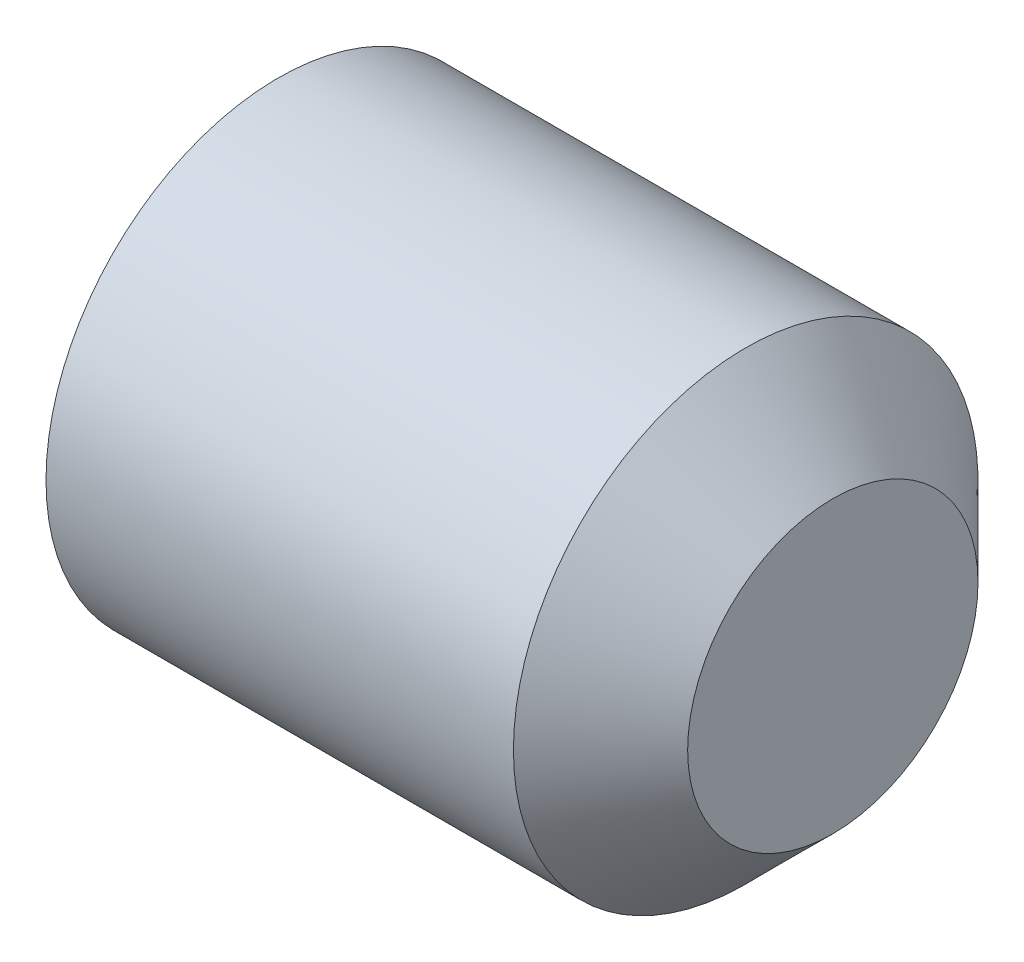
ISO-10303-21;
HEADER;
FILE_DESCRIPTION(('STEP AP214'),'2;1');
FILE_NAME('part.step','',(''),(''),'','','');
FILE_SCHEMA(('AUTOMOTIVE_DESIGN { 1 0 10303 214 1 1 1 1 }'));
ENDSEC;
DATA;
#1=APPLICATION_CONTEXT('core data for automotive mechanical design processes');
#2=APPLICATION_PROTOCOL_DEFINITION('international standard','automotive_design',2000,#1);
#3=PRODUCT_CONTEXT('',#1,'mechanical');
#4=PRODUCT('Part','Part','',(#3));
#5=PRODUCT_RELATED_PRODUCT_CATEGORY('part','',(#4));
#6=PRODUCT_DEFINITION_FORMATION('','',#4);
#7=PRODUCT_DEFINITION_CONTEXT('part definition',#1,'design');
#8=PRODUCT_DEFINITION('design','',#6,#7);
#9=PRODUCT_DEFINITION_SHAPE('','',#8);
#10=(LENGTH_UNIT() NAMED_UNIT(*) SI_UNIT(.MILLI.,.METRE.));
#11=(NAMED_UNIT(*) PLANE_ANGLE_UNIT() SI_UNIT($,.RADIAN.));
#12=(NAMED_UNIT(*) SI_UNIT($,.STERADIAN.) SOLID_ANGLE_UNIT());
#13=UNCERTAINTY_MEASURE_WITH_UNIT(LENGTH_MEASURE(1.E-05),#10,'distance_accuracy_value','');
#14=(GEOMETRIC_REPRESENTATION_CONTEXT(3) GLOBAL_UNCERTAINTY_ASSIGNED_CONTEXT((#13)) GLOBAL_UNIT_ASSIGNED_CONTEXT((#10,
#11,#12)) REPRESENTATION_CONTEXT('',''));
#15=CARTESIAN_POINT('',(0.,0.,0.));
#16=DIRECTION('',(0.,0.,1.));
#17=DIRECTION('',(1.,0.,0.));
#18=AXIS2_PLACEMENT_3D('',#15,#16,#17);
#19=CARTESIAN_POINT('',(0.,0.,0.));
#20=DIRECTION('',(-1.,0.,0.));
#21=DIRECTION('',(0.,0.,1.));
#22=AXIS2_PLACEMENT_3D('',#19,#20,#21);
#23=PLANE('',#22);
#24=CARTESIAN_POINT('',(0.,0.,0.));
#25=DIRECTION('',(-1.,0.,0.));
#26=DIRECTION('',(0.,0.,1.));
#27=AXIS2_PLACEMENT_3D('',#24,#25,#26);
#28=CIRCLE('',#27,1.61);
#29=CARTESIAN_POINT('',(0.,0.,1.61));
#30=VERTEX_POINT('',#29);
#31=EDGE_CURVE('E86',#30,#30,#28,.T.);
#32=ORIENTED_EDGE('',*,*,#31,.T.);
#33=EDGE_LOOP('',(#32));
#34=FACE_BOUND('',#33,.T.);
#35=DIRECTION('',(0.,0.,-1.));
#36=VECTOR('',#35,1.);
#37=CARTESIAN_POINT('',(0.,1.,0.577350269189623));
#38=LINE('',#37,#36);
#39=CARTESIAN_POINT('',(0.,1.,0.577350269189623));
#40=VERTEX_POINT('',#39);
#41=CARTESIAN_POINT('',(0.,1.,-0.577350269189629));
#42=VERTEX_POINT('',#41);
#43=EDGE_CURVE('E100',#40,#42,#38,.T.);
#44=ORIENTED_EDGE('',*,*,#43,.F.);
#45=DIRECTION('',(0.,-0.866025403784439,0.5));
#46=VECTOR('',#45,1.);
#47=CARTESIAN_POINT('',(0.,1.,0.577350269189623));
#48=LINE('',#47,#46);
#49=CARTESIAN_POINT('',(0.,0.,1.15470053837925));
#50=VERTEX_POINT('',#49);
#51=EDGE_CURVE('E45',#40,#50,#48,.T.);
#52=ORIENTED_EDGE('',*,*,#51,.T.);
#53=DIRECTION('',(0.,0.866025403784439,0.5));
#54=VECTOR('',#53,1.);
#55=CARTESIAN_POINT('',(0.,-0.999999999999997,0.577350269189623));
#56=LINE('',#55,#54);
#57=CARTESIAN_POINT('',(0.,-0.999999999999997,0.577350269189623));
#58=VERTEX_POINT('',#57);
#59=EDGE_CURVE('E90',#58,#50,#56,.T.);
#60=ORIENTED_EDGE('',*,*,#59,.F.);
#61=DIRECTION('',(0.,0.,-1.));
#62=VECTOR('',#61,1.);
#63=CARTESIAN_POINT('',(0.,-0.999999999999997,0.577350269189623));
#64=LINE('',#63,#62);
#65=CARTESIAN_POINT('',(0.,-0.999999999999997,-0.577350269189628));
#66=VERTEX_POINT('',#65);
#67=EDGE_CURVE('E95',#58,#66,#64,.T.);
#68=ORIENTED_EDGE('',*,*,#67,.T.);
#69=DIRECTION('',(0.,0.866025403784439,-0.5));
#70=VECTOR('',#69,1.);
#71=CARTESIAN_POINT('',(0.,-0.999999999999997,-0.577350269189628));
#72=LINE('',#71,#70);
#73=CARTESIAN_POINT('',(0.,0.,-1.15470053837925));
#74=VERTEX_POINT('',#73);
#75=EDGE_CURVE('E104',#66,#74,#72,.T.);
#76=ORIENTED_EDGE('',*,*,#75,.T.);
#77=DIRECTION('',(0.,-0.866025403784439,-0.499999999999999));
#78=VECTOR('',#77,1.);
#79=CARTESIAN_POINT('',(0.,1.,-0.577350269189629));
#80=LINE('',#79,#78);
#81=EDGE_CURVE('E107',#42,#74,#80,.T.);
#82=ORIENTED_EDGE('',*,*,#81,.F.);
#83=EDGE_LOOP('',(#44,#52,#60,#68,#76,#82));
#84=FACE_BOUND('',#83,.T.);
#85=ADVANCED_FACE('F30',(#34,#84),#23,.T.);
#86=CARTESIAN_POINT('',(5.,1.25,0.));
#87=DIRECTION('',(1.,0.,0.));
#88=DIRECTION('',(0.,0.,-1.));
#89=AXIS2_PLACEMENT_3D('',#86,#87,#88);
#90=PLANE('',#89);
#91=CARTESIAN_POINT('',(5.,0.,0.));
#92=DIRECTION('',(-1.,0.,0.));
#93=DIRECTION('',(0.,0.,1.));
#94=AXIS2_PLACEMENT_3D('',#91,#92,#93);
#95=CIRCLE('',#94,1.25);
#96=CARTESIAN_POINT('',(5.,0.,1.25));
#97=VERTEX_POINT('',#96);
#98=EDGE_CURVE('E11',#97,#97,#95,.T.);
#99=ORIENTED_EDGE('',*,*,#98,.F.);
#100=EDGE_LOOP('',(#99));
#101=FACE_BOUND('',#100,.T.);
#102=ADVANCED_FACE('F32',(#101),#90,.T.);
#103=CARTESIAN_POINT('',(4.25000000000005,0.,0.));
#104=DIRECTION('',(-1.,0.,0.));
#105=DIRECTION('',(0.,0.,1.));
#106=AXIS2_PLACEMENT_3D('',#103,#104,#105);
#107=CONICAL_SURFACE('',#106,2.,0.785398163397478);
#108=ORIENTED_EDGE('',*,*,#98,.T.);
#109=EDGE_LOOP('',(#108));
#110=FACE_BOUND('',#109,.T.);
#111=CARTESIAN_POINT('',(4.25000000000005,0.,0.));
#112=DIRECTION('',(-1.,0.,0.));
#113=DIRECTION('',(0.,0.,1.));
#114=AXIS2_PLACEMENT_3D('',#111,#112,#113);
#115=CIRCLE('',#114,2.);
#116=CARTESIAN_POINT('',(4.25000000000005,0.,2.));
#117=VERTEX_POINT('',#116);
#118=EDGE_CURVE('E38',#117,#117,#115,.T.);
#119=ORIENTED_EDGE('',*,*,#118,.F.);
#120=EDGE_LOOP('',(#119));
#121=FACE_BOUND('',#120,.T.);
#122=ADVANCED_FACE('F142',(#110,#121),#107,.T.);
#123=CARTESIAN_POINT('',(-12.7,0.,0.));
#124=DIRECTION('',(-1.,0.,0.));
#125=DIRECTION('',(0.,0.,1.));
#126=AXIS2_PLACEMENT_3D('',#123,#124,#125);
#127=CYLINDRICAL_SURFACE('',#126,2.);
#128=ORIENTED_EDGE('',*,*,#118,.T.);
#129=EDGE_LOOP('',(#128));
#130=FACE_BOUND('',#129,.T.);
#131=CARTESIAN_POINT('',(0.225166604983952,0.,0.));
#132=DIRECTION('',(-1.,0.,0.));
#133=DIRECTION('',(0.,0.,1.));
#134=AXIS2_PLACEMENT_3D('',#131,#132,#133);
#135=CIRCLE('',#134,2.);
#136=CARTESIAN_POINT('',(0.225166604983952,0.,2.));
#137=VERTEX_POINT('',#136);
#138=EDGE_CURVE('E134',#137,#137,#135,.T.);
#139=ORIENTED_EDGE('',*,*,#138,.F.);
#140=EDGE_LOOP('',(#139));
#141=FACE_BOUND('',#140,.T.);
#142=ADVANCED_FACE('F139',(#130,#141),#127,.T.);
#143=CARTESIAN_POINT('',(0.,0.,0.));
#144=DIRECTION('',(1.,0.,0.));
#145=DIRECTION('',(0.,0.,-1.));
#146=AXIS2_PLACEMENT_3D('',#143,#144,#145);
#147=CONICAL_SURFACE('',#146,1.61,1.0471975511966);
#148=ORIENTED_EDGE('',*,*,#138,.T.);
#149=EDGE_LOOP('',(#148));
#150=FACE_BOUND('',#149,.T.);
#151=ORIENTED_EDGE('',*,*,#31,.F.);
#152=EDGE_LOOP('',(#151));
#153=FACE_BOUND('',#152,.T.);
#154=ADVANCED_FACE('F149',(#150,#153),#147,.T.);
#155=CARTESIAN_POINT('',(2.3,1.,0.577350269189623));
#156=DIRECTION('',(0.,-0.5,-0.866025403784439));
#157=DIRECTION('',(0.,0.866025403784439,-0.5));
#158=AXIS2_PLACEMENT_3D('',#155,#156,#157);
#159=PLANE('',#158);
#160=ORIENTED_EDGE('',*,*,#51,.F.);
#161=DIRECTION('',(-1.,0.,0.));
#162=VECTOR('',#161,1.);
#163=CARTESIAN_POINT('',(2.3,1.,0.577350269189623));
#164=LINE('',#163,#162);
#165=CARTESIAN_POINT('',(2.3,1.,0.577350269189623));
#166=VERTEX_POINT('',#165);
#167=EDGE_CURVE('E49',#166,#40,#164,.T.);
#168=ORIENTED_EDGE('',*,*,#167,.F.);
#169=DIRECTION('',(0.,-0.866025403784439,0.5));
#170=VECTOR('',#169,1.);
#171=CARTESIAN_POINT('',(2.3,1.,0.577350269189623));
#172=LINE('',#171,#170);
#173=CARTESIAN_POINT('',(2.3,0.,1.15470053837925));
#174=VERTEX_POINT('',#173);
#175=EDGE_CURVE('E82',#166,#174,#172,.T.);
#176=ORIENTED_EDGE('',*,*,#175,.T.);
#177=DIRECTION('',(-1.,0.,0.));
#178=VECTOR('',#177,1.);
#179=CARTESIAN_POINT('',(2.3,0.,1.15470053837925));
#180=LINE('',#179,#178);
#181=EDGE_CURVE('E79',#174,#50,#180,.T.);
#182=ORIENTED_EDGE('',*,*,#181,.T.);
#183=EDGE_LOOP('',(#160,#168,#176,#182));
#184=FACE_BOUND('',#183,.T.);
#185=ADVANCED_FACE('F81',(#184),#159,.T.);
#186=CARTESIAN_POINT('',(2.3,-0.999999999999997,0.577350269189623));
#187=DIRECTION('',(0.,-0.5,0.866025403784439));
#188=DIRECTION('',(0.,-0.866025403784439,-0.5));
#189=AXIS2_PLACEMENT_3D('',#186,#187,#188);
#190=PLANE('',#189);
#191=ORIENTED_EDGE('',*,*,#59,.T.);
#192=ORIENTED_EDGE('',*,*,#181,.F.);
#193=DIRECTION('',(0.,0.866025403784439,0.5));
#194=VECTOR('',#193,1.);
#195=CARTESIAN_POINT('',(2.3,-0.999999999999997,0.577350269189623));
#196=LINE('',#195,#194);
#197=CARTESIAN_POINT('',(2.3,-0.999999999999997,0.577350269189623));
#198=VERTEX_POINT('',#197);
#199=EDGE_CURVE('E112',#198,#174,#196,.T.);
#200=ORIENTED_EDGE('',*,*,#199,.F.);
#201=DIRECTION('',(-1.,0.,0.));
#202=VECTOR('',#201,1.);
#203=CARTESIAN_POINT('',(2.3,-0.999999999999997,0.577350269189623));
#204=LINE('',#203,#202);
#205=EDGE_CURVE('E87',#198,#58,#204,.T.);
#206=ORIENTED_EDGE('',*,*,#205,.T.);
#207=EDGE_LOOP('',(#191,#192,#200,#206));
#208=FACE_BOUND('',#207,.T.);
#209=ADVANCED_FACE('F91',(#208),#190,.F.);
#210=CARTESIAN_POINT('',(2.3,-0.999999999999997,0.577350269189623));
#211=DIRECTION('',(0.,1.,0.));
#212=DIRECTION('',(0.,0.,1.));
#213=AXIS2_PLACEMENT_3D('',#210,#211,#212);
#214=PLANE('',#213);
#215=ORIENTED_EDGE('',*,*,#67,.F.);
#216=ORIENTED_EDGE('',*,*,#205,.F.);
#217=DIRECTION('',(0.,0.,-1.));
#218=VECTOR('',#217,1.);
#219=CARTESIAN_POINT('',(2.3,-0.999999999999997,0.577350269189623));
#220=LINE('',#219,#218);
#221=CARTESIAN_POINT('',(2.3,-0.999999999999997,-0.577350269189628));
#222=VERTEX_POINT('',#221);
#223=EDGE_CURVE('E114',#198,#222,#220,.T.);
#224=ORIENTED_EDGE('',*,*,#223,.T.);
#225=DIRECTION('',(-1.,0.,0.));
#226=VECTOR('',#225,1.);
#227=CARTESIAN_POINT('',(2.3,-0.999999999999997,-0.577350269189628));
#228=LINE('',#227,#226);
#229=EDGE_CURVE('E129',#222,#66,#228,.T.);
#230=ORIENTED_EDGE('',*,*,#229,.T.);
#231=EDGE_LOOP('',(#215,#216,#224,#230));
#232=FACE_BOUND('',#231,.T.);
#233=ADVANCED_FACE('F171',(#232),#214,.T.);
#234=CARTESIAN_POINT('',(2.3,-0.999999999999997,-0.577350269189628));
#235=DIRECTION('',(0.,0.5,0.866025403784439));
#236=DIRECTION('',(0.,-0.866025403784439,0.5));
#237=AXIS2_PLACEMENT_3D('',#234,#235,#236);
#238=PLANE('',#237);
#239=ORIENTED_EDGE('',*,*,#75,.F.);
#240=ORIENTED_EDGE('',*,*,#229,.F.);
#241=DIRECTION('',(0.,0.866025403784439,-0.5));
#242=VECTOR('',#241,1.);
#243=CARTESIAN_POINT('',(2.3,-0.999999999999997,-0.577350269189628));
#244=LINE('',#243,#242);
#245=CARTESIAN_POINT('',(2.3,0.,-1.15470053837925));
#246=VERTEX_POINT('',#245);
#247=EDGE_CURVE('E116',#222,#246,#244,.T.);
#248=ORIENTED_EDGE('',*,*,#247,.T.);
#249=DIRECTION('',(-1.,0.,0.));
#250=VECTOR('',#249,1.);
#251=CARTESIAN_POINT('',(2.3,0.,-1.15470053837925));
#252=LINE('',#251,#250);
#253=EDGE_CURVE('E127',#246,#74,#252,.T.);
#254=ORIENTED_EDGE('',*,*,#253,.T.);
#255=EDGE_LOOP('',(#239,#240,#248,#254));
#256=FACE_BOUND('',#255,.T.);
#257=ADVANCED_FACE('F175',(#256),#238,.T.);
#258=CARTESIAN_POINT('',(2.3,1.,-0.577350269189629));
#259=DIRECTION('',(0.,0.5,-0.866025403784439));
#260=DIRECTION('',(0.,0.866025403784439,0.5));
#261=AXIS2_PLACEMENT_3D('',#258,#259,#260);
#262=PLANE('',#261);
#263=ORIENTED_EDGE('',*,*,#81,.T.);
#264=ORIENTED_EDGE('',*,*,#253,.F.);
#265=DIRECTION('',(0.,-0.866025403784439,-0.499999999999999));
#266=VECTOR('',#265,1.);
#267=CARTESIAN_POINT('',(2.3,1.,-0.577350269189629));
#268=LINE('',#267,#266);
#269=CARTESIAN_POINT('',(2.3,1.,-0.577350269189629));
#270=VERTEX_POINT('',#269);
#271=EDGE_CURVE('E118',#270,#246,#268,.T.);
#272=ORIENTED_EDGE('',*,*,#271,.F.);
#273=DIRECTION('',(-1.,0.,0.));
#274=VECTOR('',#273,1.);
#275=CARTESIAN_POINT('',(2.3,1.,-0.577350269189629));
#276=LINE('',#275,#274);
#277=EDGE_CURVE('E125',#270,#42,#276,.T.);
#278=ORIENTED_EDGE('',*,*,#277,.T.);
#279=EDGE_LOOP('',(#263,#264,#272,#278));
#280=FACE_BOUND('',#279,.T.);
#281=ADVANCED_FACE('F181',(#280),#262,.F.);
#282=CARTESIAN_POINT('',(2.3,1.,0.577350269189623));
#283=DIRECTION('',(0.,1.,0.));
#284=DIRECTION('',(0.,0.,1.));
#285=AXIS2_PLACEMENT_3D('',#282,#283,#284);
#286=PLANE('',#285);
#287=ORIENTED_EDGE('',*,*,#43,.T.);
#288=ORIENTED_EDGE('',*,*,#277,.F.);
#289=DIRECTION('',(0.,0.,-1.));
#290=VECTOR('',#289,1.);
#291=CARTESIAN_POINT('',(2.3,1.,0.577350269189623));
#292=LINE('',#291,#290);
#293=EDGE_CURVE('E121',#166,#270,#292,.T.);
#294=ORIENTED_EDGE('',*,*,#293,.F.);
#295=ORIENTED_EDGE('',*,*,#167,.T.);
#296=EDGE_LOOP('',(#287,#288,#294,#295));
#297=FACE_BOUND('',#296,.T.);
#298=ADVANCED_FACE('F185',(#297),#286,.F.);
#299=CARTESIAN_POINT('',(2.3,-0.999999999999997,1.73205080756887));
#300=DIRECTION('',(1.,0.,0.));
#301=DIRECTION('',(0.,0.,-1.));
#302=AXIS2_PLACEMENT_3D('',#299,#300,#301);
#303=PLANE('',#302);
#304=ORIENTED_EDGE('',*,*,#175,.F.);
#305=ORIENTED_EDGE('',*,*,#293,.T.);
#306=ORIENTED_EDGE('',*,*,#271,.T.);
#307=ORIENTED_EDGE('',*,*,#247,.F.);
#308=ORIENTED_EDGE('',*,*,#223,.F.);
#309=ORIENTED_EDGE('',*,*,#199,.T.);
#310=EDGE_LOOP('',(#304,#305,#306,#307,#308,#309));
#311=FACE_BOUND('',#310,.T.);
#312=ADVANCED_FACE('F189',(#311),#303,.F.);
#313=CLOSED_SHELL('',(#85,#102,#122,#142,#154,#185,#209,#233,#257,#281,#298,#312));
#314=MANIFOLD_SOLID_BREP('B2',#313);
#315=ADVANCED_BREP_SHAPE_REPRESENTATION('',(#18,#314),#14);
#316=SHAPE_DEFINITION_REPRESENTATION(#9,#315);
ENDSEC;
END-ISO-10303-21;
